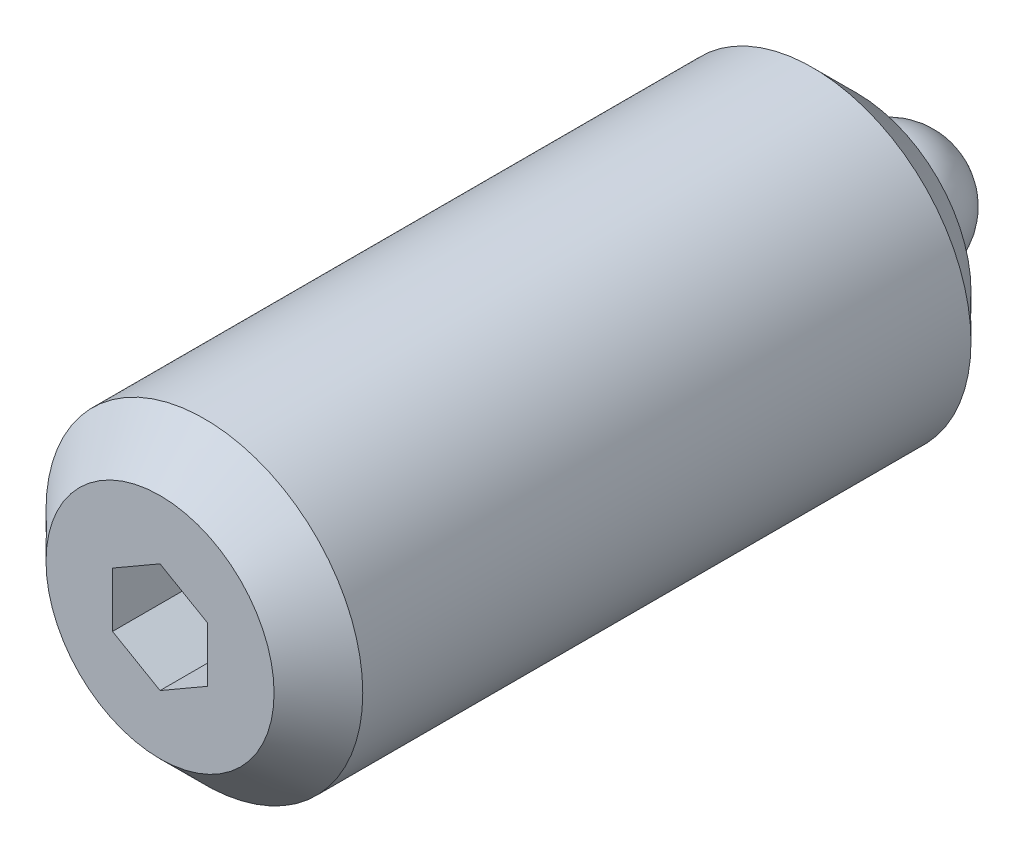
ISO-10303-21;
HEADER;
FILE_DESCRIPTION(('STEP AP214'),'2;1');
FILE_NAME('part.step','',(''),(''),'','','');
FILE_SCHEMA(('AUTOMOTIVE_DESIGN { 1 0 10303 214 1 1 1 1 }'));
ENDSEC;
DATA;
#1=APPLICATION_CONTEXT('core data for automotive mechanical design processes');
#2=APPLICATION_PROTOCOL_DEFINITION('international standard','automotive_design',2000,#1);
#3=PRODUCT_CONTEXT('',#1,'mechanical');
#4=PRODUCT('Part','Part','',(#3));
#5=PRODUCT_RELATED_PRODUCT_CATEGORY('part','',(#4));
#6=PRODUCT_DEFINITION_FORMATION('','',#4);
#7=PRODUCT_DEFINITION_CONTEXT('part definition',#1,'design');
#8=PRODUCT_DEFINITION('design','',#6,#7);
#9=PRODUCT_DEFINITION_SHAPE('','',#8);
#10=(LENGTH_UNIT() NAMED_UNIT(*) SI_UNIT(.MILLI.,.METRE.));
#11=(NAMED_UNIT(*) PLANE_ANGLE_UNIT() SI_UNIT($,.RADIAN.));
#12=(NAMED_UNIT(*) SI_UNIT($,.STERADIAN.) SOLID_ANGLE_UNIT());
#13=UNCERTAINTY_MEASURE_WITH_UNIT(LENGTH_MEASURE(1.E-05),#10,'distance_accuracy_value','');
#14=(GEOMETRIC_REPRESENTATION_CONTEXT(3) GLOBAL_UNCERTAINTY_ASSIGNED_CONTEXT((#13)) GLOBAL_UNIT_ASSIGNED_CONTEXT((#10,
#11,#12)) REPRESENTATION_CONTEXT('',''));
#15=CARTESIAN_POINT('',(0.,0.,0.));
#16=DIRECTION('',(0.,0.,1.));
#17=DIRECTION('',(1.,0.,0.));
#18=AXIS2_PLACEMENT_3D('',#15,#16,#17);
#19=CARTESIAN_POINT('',(0.,5.,25.));
#20=DIRECTION('',(0.,0.,1.));
#21=DIRECTION('',(1.,0.,0.));
#22=AXIS2_PLACEMENT_3D('',#19,#20,#21);
#23=PLANE('',#22);
#24=CARTESIAN_POINT('',(0.,0.,25.));
#25=DIRECTION('',(0.,0.,1.));
#26=DIRECTION('',(1.,0.,0.));
#27=AXIS2_PLACEMENT_3D('',#24,#25,#26);
#28=CIRCLE('',#27,3.6);
#29=CARTESIAN_POINT('',(3.6,0.,25.));
#30=VERTEX_POINT('',#29);
#31=EDGE_CURVE('E9',#30,#30,#28,.T.);
#32=ORIENTED_EDGE('',*,*,#31,.T.);
#33=EDGE_LOOP('',(#32));
#34=FACE_BOUND('',#33,.T.);
#35=DIRECTION('',(0.866025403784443,-0.499999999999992,0.));
#36=VECTOR('',#35,1.);
#37=CARTESIAN_POINT('',(-1.5,-0.866025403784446,25.));
#38=LINE('',#37,#36);
#39=CARTESIAN_POINT('',(-1.5,-0.866025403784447,25.));
#40=VERTEX_POINT('',#39);
#41=CARTESIAN_POINT('',(0.,-1.73205080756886,25.));
#42=VERTEX_POINT('',#41);
#43=EDGE_CURVE('E84',#40,#42,#38,.T.);
#44=ORIENTED_EDGE('',*,*,#43,.F.);
#45=DIRECTION('',(0.,1.,0.));
#46=VECTOR('',#45,1.);
#47=CARTESIAN_POINT('',(-1.5,-0.866025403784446,25.));
#48=LINE('',#47,#46);
#49=CARTESIAN_POINT('',(-1.5,0.866025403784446,25.));
#50=VERTEX_POINT('',#49);
#51=EDGE_CURVE('E29',#40,#50,#48,.T.);
#52=ORIENTED_EDGE('',*,*,#51,.T.);
#53=DIRECTION('',(0.866025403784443,0.499999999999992,0.));
#54=VECTOR('',#53,1.);
#55=CARTESIAN_POINT('',(-1.5,0.866025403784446,25.));
#56=LINE('',#55,#54);
#57=CARTESIAN_POINT('',(0.,1.73205080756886,25.));
#58=VERTEX_POINT('',#57);
#59=EDGE_CURVE('E74',#50,#58,#56,.T.);
#60=ORIENTED_EDGE('',*,*,#59,.T.);
#61=DIRECTION('',(-0.866025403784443,0.499999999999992,0.));
#62=VECTOR('',#61,1.);
#63=CARTESIAN_POINT('',(1.5,0.866025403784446,25.));
#64=LINE('',#63,#62);
#65=CARTESIAN_POINT('',(1.5,0.866025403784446,25.));
#66=VERTEX_POINT('',#65);
#67=EDGE_CURVE('E79',#66,#58,#64,.T.);
#68=ORIENTED_EDGE('',*,*,#67,.F.);
#69=DIRECTION('',(0.,1.,0.));
#70=VECTOR('',#69,1.);
#71=CARTESIAN_POINT('',(1.5,-0.866025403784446,25.));
#72=LINE('',#71,#70);
#73=CARTESIAN_POINT('',(1.5,-0.866025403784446,25.));
#74=VERTEX_POINT('',#73);
#75=EDGE_CURVE('E88',#74,#66,#72,.T.);
#76=ORIENTED_EDGE('',*,*,#75,.F.);
#77=DIRECTION('',(-0.866025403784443,-0.499999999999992,0.));
#78=VECTOR('',#77,1.);
#79=CARTESIAN_POINT('',(1.5,-0.866025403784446,25.));
#80=LINE('',#79,#78);
#81=EDGE_CURVE('E91',#74,#42,#80,.T.);
#82=ORIENTED_EDGE('',*,*,#81,.T.);
#83=EDGE_LOOP('',(#44,#52,#60,#68,#76,#82));
#84=FACE_BOUND('',#83,.T.);
#85=ADVANCED_FACE('F14',(#34,#84),#23,.T.);
#86=CARTESIAN_POINT('',(0.,0.,2.));
#87=DIRECTION('',(-1.,0.,0.));
#88=DIRECTION('',(0.,0.,1.));
#89=AXIS2_PLACEMENT_3D('',#86,#87,#88);
#90=SPHERICAL_SURFACE('',#89,2.);
#91=CARTESIAN_POINT('',(0.,0.,2.));
#92=DIRECTION('',(0.,0.,-1.));
#93=DIRECTION('',(-1.,0.,0.));
#94=AXIS2_PLACEMENT_3D('',#91,#92,#93);
#95=SPHERICAL_SURFACE('',#94,2.);
#96=CARTESIAN_POINT('',(0.,0.,2.));
#97=DIRECTION('',(0.,0.,-1.));
#98=DIRECTION('',(-1.,0.,0.));
#99=AXIS2_PLACEMENT_3D('',#96,#97,#98);
#100=CIRCLE('',#99,2.);
#101=CARTESIAN_POINT('',(-2.,0.,2.));
#102=VERTEX_POINT('',#101);
#103=EDGE_CURVE('E70',#102,#102,#100,.T.);
#104=ORIENTED_EDGE('',*,*,#103,.T.);
#105=EDGE_LOOP('',(#104));
#106=FACE_BOUND('',#105,.T.);
#107=ADVANCED_FACE('F152',(#106),#95,.T.);
#108=CARTESIAN_POINT('',(0.,0.,-1.));
#109=DIRECTION('',(0.,0.,-1.));
#110=DIRECTION('',(-1.,0.,0.));
#111=AXIS2_PLACEMENT_3D('',#108,#109,#110);
#112=CYLINDRICAL_SURFACE('',#111,5.);
#113=CARTESIAN_POINT('',(0.,0.,4.4));
#114=DIRECTION('',(0.,0.,-1.));
#115=DIRECTION('',(-1.,0.,0.));
#116=AXIS2_PLACEMENT_3D('',#113,#114,#115);
#117=CIRCLE('',#116,5.);
#118=CARTESIAN_POINT('',(-5.,0.,4.4));
#119=VERTEX_POINT('',#118);
#120=EDGE_CURVE('E22',#119,#119,#117,.F.);
#121=ORIENTED_EDGE('',*,*,#120,.T.);
#122=EDGE_LOOP('',(#121));
#123=FACE_BOUND('',#122,.T.);
#124=CARTESIAN_POINT('',(0.,0.,23.6));
#125=DIRECTION('',(0.,0.,1.));
#126=DIRECTION('',(1.,0.,0.));
#127=AXIS2_PLACEMENT_3D('',#124,#125,#126);
#128=CIRCLE('',#127,5.);
#129=CARTESIAN_POINT('',(5.,0.,23.6));
#130=VERTEX_POINT('',#129);
#131=EDGE_CURVE('E125',#130,#130,#128,.F.);
#132=ORIENTED_EDGE('',*,*,#131,.T.);
#133=EDGE_LOOP('',(#132));
#134=FACE_BOUND('',#133,.T.);
#135=ADVANCED_FACE('F130',(#123,#134),#112,.T.);
#136=CARTESIAN_POINT('',(0.,2.,3.));
#137=DIRECTION('',(0.,0.,-1.));
#138=DIRECTION('',(-1.,0.,0.));
#139=AXIS2_PLACEMENT_3D('',#136,#137,#138);
#140=PLANE('',#139);
#141=CARTESIAN_POINT('',(0.,0.,3.));
#142=DIRECTION('',(0.,0.,-1.));
#143=DIRECTION('',(-1.,0.,0.));
#144=AXIS2_PLACEMENT_3D('',#141,#142,#143);
#145=CIRCLE('',#144,3.6);
#146=CARTESIAN_POINT('',(-3.6,0.,3.));
#147=VERTEX_POINT('',#146);
#148=EDGE_CURVE('E122',#147,#147,#145,.T.);
#149=ORIENTED_EDGE('',*,*,#148,.T.);
#150=EDGE_LOOP('',(#149));
#151=FACE_BOUND('',#150,.T.);
#152=CARTESIAN_POINT('',(0.,0.,3.));
#153=DIRECTION('',(0.,0.,-1.));
#154=DIRECTION('',(-1.,0.,0.));
#155=AXIS2_PLACEMENT_3D('',#152,#153,#154);
#156=CIRCLE('',#155,2.);
#157=CARTESIAN_POINT('',(-2.,0.,3.));
#158=VERTEX_POINT('',#157);
#159=EDGE_CURVE('E119',#158,#158,#156,.T.);
#160=ORIENTED_EDGE('',*,*,#159,.F.);
#161=EDGE_LOOP('',(#160));
#162=FACE_BOUND('',#161,.T.);
#163=ADVANCED_FACE('F140',(#151,#162),#140,.T.);
#164=CARTESIAN_POINT('',(0.,0.,-1.));
#165=DIRECTION('',(0.,0.,-1.));
#166=DIRECTION('',(-1.,0.,0.));
#167=AXIS2_PLACEMENT_3D('',#164,#165,#166);
#168=CYLINDRICAL_SURFACE('',#167,2.);
#169=ORIENTED_EDGE('',*,*,#159,.T.);
#170=EDGE_LOOP('',(#169));
#171=FACE_BOUND('',#170,.T.);
#172=ORIENTED_EDGE('',*,*,#103,.F.);
#173=EDGE_LOOP('',(#172));
#174=FACE_BOUND('',#173,.T.);
#175=ADVANCED_FACE('F143',(#171,#174),#168,.T.);
#176=CARTESIAN_POINT('',(-1.5,-0.866025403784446,21.5));
#177=DIRECTION('',(1.,0.,0.));
#178=DIRECTION('',(0.,0.,-1.));
#179=AXIS2_PLACEMENT_3D('',#176,#177,#178);
#180=PLANE('',#179);
#181=DIRECTION('',(0.,0.,1.));
#182=VECTOR('',#181,1.);
#183=CARTESIAN_POINT('',(-1.5,0.866025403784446,21.5));
#184=LINE('',#183,#182);
#185=CARTESIAN_POINT('',(-1.5,0.866025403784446,21.5));
#186=VERTEX_POINT('',#185);
#187=EDGE_CURVE('E63',#186,#50,#184,.T.);
#188=ORIENTED_EDGE('',*,*,#187,.T.);
#189=ORIENTED_EDGE('',*,*,#51,.F.);
#190=DIRECTION('',(0.,0.,1.));
#191=VECTOR('',#190,1.);
#192=CARTESIAN_POINT('',(-1.5,-0.866025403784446,21.5));
#193=LINE('',#192,#191);
#194=CARTESIAN_POINT('',(-1.5,-0.866025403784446,21.5));
#195=VERTEX_POINT('',#194);
#196=EDGE_CURVE('E33',#195,#40,#193,.T.);
#197=ORIENTED_EDGE('',*,*,#196,.F.);
#198=DIRECTION('',(0.,1.,0.));
#199=VECTOR('',#198,1.);
#200=CARTESIAN_POINT('',(-1.5,-0.866025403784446,21.5));
#201=LINE('',#200,#199);
#202=EDGE_CURVE('E66',#195,#186,#201,.T.);
#203=ORIENTED_EDGE('',*,*,#202,.T.);
#204=EDGE_LOOP('',(#188,#189,#197,#203));
#205=FACE_BOUND('',#204,.T.);
#206=ADVANCED_FACE('F65',(#205),#180,.T.);
#207=CARTESIAN_POINT('',(-1.5,0.866025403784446,21.5));
#208=DIRECTION('',(0.499999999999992,-0.866025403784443,0.));
#209=DIRECTION('',(0.866025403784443,0.499999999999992,0.));
#210=AXIS2_PLACEMENT_3D('',#207,#208,#209);
#211=PLANE('',#210);
#212=DIRECTION('',(0.,0.,1.));
#213=VECTOR('',#212,1.);
#214=CARTESIAN_POINT('',(0.,1.73205080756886,21.5));
#215=LINE('',#214,#213);
#216=CARTESIAN_POINT('',(0.,1.73205080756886,21.5));
#217=VERTEX_POINT('',#216);
#218=EDGE_CURVE('E71',#217,#58,#215,.T.);
#219=ORIENTED_EDGE('',*,*,#218,.T.);
#220=ORIENTED_EDGE('',*,*,#59,.F.);
#221=ORIENTED_EDGE('',*,*,#187,.F.);
#222=DIRECTION('',(0.866025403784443,0.499999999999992,0.));
#223=VECTOR('',#222,1.);
#224=CARTESIAN_POINT('',(-1.5,0.866025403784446,21.5));
#225=LINE('',#224,#223);
#226=EDGE_CURVE('E95',#186,#217,#225,.T.);
#227=ORIENTED_EDGE('',*,*,#226,.T.);
#228=EDGE_LOOP('',(#219,#220,#221,#227));
#229=FACE_BOUND('',#228,.T.);
#230=ADVANCED_FACE('F75',(#229),#211,.T.);
#231=CARTESIAN_POINT('',(1.5,0.866025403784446,21.5));
#232=DIRECTION('',(0.499999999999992,0.866025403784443,0.));
#233=DIRECTION('',(-0.866025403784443,0.499999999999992,0.));
#234=AXIS2_PLACEMENT_3D('',#231,#232,#233);
#235=PLANE('',#234);
#236=DIRECTION('',(0.,0.,1.));
#237=VECTOR('',#236,1.);
#238=CARTESIAN_POINT('',(1.5,0.866025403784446,21.5));
#239=LINE('',#238,#237);
#240=CARTESIAN_POINT('',(1.5,0.866025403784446,21.5));
#241=VERTEX_POINT('',#240);
#242=EDGE_CURVE('E114',#241,#66,#239,.T.);
#243=ORIENTED_EDGE('',*,*,#242,.T.);
#244=ORIENTED_EDGE('',*,*,#67,.T.);
#245=ORIENTED_EDGE('',*,*,#218,.F.);
#246=DIRECTION('',(-0.866025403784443,0.499999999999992,0.));
#247=VECTOR('',#246,1.);
#248=CARTESIAN_POINT('',(1.5,0.866025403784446,21.5));
#249=LINE('',#248,#247);
#250=EDGE_CURVE('E97',#241,#217,#249,.T.);
#251=ORIENTED_EDGE('',*,*,#250,.F.);
#252=EDGE_LOOP('',(#243,#244,#245,#251));
#253=FACE_BOUND('',#252,.T.);
#254=ADVANCED_FACE('F167',(#253),#235,.F.);
#255=CARTESIAN_POINT('',(1.5,-0.866025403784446,21.5));
#256=DIRECTION('',(1.,0.,0.));
#257=DIRECTION('',(0.,0.,-1.));
#258=AXIS2_PLACEMENT_3D('',#255,#256,#257);
#259=PLANE('',#258);
#260=DIRECTION('',(0.,0.,1.));
#261=VECTOR('',#260,1.);
#262=CARTESIAN_POINT('',(1.5,-0.866025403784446,21.5));
#263=LINE('',#262,#261);
#264=CARTESIAN_POINT('',(1.5,-0.866025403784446,21.5));
#265=VERTEX_POINT('',#264);
#266=EDGE_CURVE('E112',#265,#74,#263,.T.);
#267=ORIENTED_EDGE('',*,*,#266,.T.);
#268=ORIENTED_EDGE('',*,*,#75,.T.);
#269=ORIENTED_EDGE('',*,*,#242,.F.);
#270=DIRECTION('',(0.,1.,0.));
#271=VECTOR('',#270,1.);
#272=CARTESIAN_POINT('',(1.5,-0.866025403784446,21.5));
#273=LINE('',#272,#271);
#274=EDGE_CURVE('E100',#265,#241,#273,.T.);
#275=ORIENTED_EDGE('',*,*,#274,.F.);
#276=EDGE_LOOP('',(#267,#268,#269,#275));
#277=FACE_BOUND('',#276,.T.);
#278=ADVANCED_FACE('F170',(#277),#259,.F.);
#279=CARTESIAN_POINT('',(1.5,-0.866025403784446,21.5));
#280=DIRECTION('',(-0.499999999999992,0.866025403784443,0.));
#281=DIRECTION('',(-0.866025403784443,-0.499999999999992,0.));
#282=AXIS2_PLACEMENT_3D('',#279,#280,#281);
#283=PLANE('',#282);
#284=DIRECTION('',(0.,0.,1.));
#285=VECTOR('',#284,1.);
#286=CARTESIAN_POINT('',(0.,-1.73205080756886,21.5));
#287=LINE('',#286,#285);
#288=CARTESIAN_POINT('',(0.,-1.73205080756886,21.5));
#289=VERTEX_POINT('',#288);
#290=EDGE_CURVE('E110',#289,#42,#287,.T.);
#291=ORIENTED_EDGE('',*,*,#290,.T.);
#292=ORIENTED_EDGE('',*,*,#81,.F.);
#293=ORIENTED_EDGE('',*,*,#266,.F.);
#294=DIRECTION('',(-0.866025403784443,-0.499999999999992,0.));
#295=VECTOR('',#294,1.);
#296=CARTESIAN_POINT('',(1.5,-0.866025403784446,21.5));
#297=LINE('',#296,#295);
#298=EDGE_CURVE('E103',#265,#289,#297,.T.);
#299=ORIENTED_EDGE('',*,*,#298,.T.);
#300=EDGE_LOOP('',(#291,#292,#293,#299));
#301=FACE_BOUND('',#300,.T.);
#302=ADVANCED_FACE('F174',(#301),#283,.T.);
#303=CARTESIAN_POINT('',(-1.5,-0.866025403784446,21.5));
#304=DIRECTION('',(-0.499999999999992,-0.866025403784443,0.));
#305=DIRECTION('',(0.866025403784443,-0.499999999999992,0.));
#306=AXIS2_PLACEMENT_3D('',#303,#304,#305);
#307=PLANE('',#306);
#308=DIRECTION('',(0.866025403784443,-0.499999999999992,0.));
#309=VECTOR('',#308,1.);
#310=CARTESIAN_POINT('',(-1.5,-0.866025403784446,21.5));
#311=LINE('',#310,#309);
#312=EDGE_CURVE('E106',#195,#289,#311,.T.);
#313=ORIENTED_EDGE('',*,*,#312,.F.);
#314=ORIENTED_EDGE('',*,*,#196,.T.);
#315=ORIENTED_EDGE('',*,*,#43,.T.);
#316=ORIENTED_EDGE('',*,*,#290,.F.);
#317=EDGE_LOOP('',(#313,#314,#315,#316));
#318=FACE_BOUND('',#317,.T.);
#319=ADVANCED_FACE('F137',(#318),#307,.F.);
#320=CARTESIAN_POINT('',(-1.5,2.59807621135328,21.5));
#321=DIRECTION('',(0.,0.,1.));
#322=DIRECTION('',(1.,0.,0.));
#323=AXIS2_PLACEMENT_3D('',#320,#321,#322);
#324=PLANE('',#323);
#325=ORIENTED_EDGE('',*,*,#202,.F.);
#326=ORIENTED_EDGE('',*,*,#312,.T.);
#327=ORIENTED_EDGE('',*,*,#298,.F.);
#328=ORIENTED_EDGE('',*,*,#274,.T.);
#329=ORIENTED_EDGE('',*,*,#250,.T.);
#330=ORIENTED_EDGE('',*,*,#226,.F.);
#331=EDGE_LOOP('',(#325,#326,#327,#328,#329,#330));
#332=FACE_BOUND('',#331,.T.);
#333=ADVANCED_FACE('F136',(#332),#324,.T.);
#334=CARTESIAN_POINT('',(0.,0.,3.));
#335=DIRECTION('',(0.,0.,1.));
#336=DIRECTION('',(1.,0.,0.));
#337=AXIS2_PLACEMENT_3D('',#334,#335,#336);
#338=CONICAL_SURFACE('',#337,3.6,0.785398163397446);
#339=ORIENTED_EDGE('',*,*,#120,.F.);
#340=EDGE_LOOP('',(#339));
#341=FACE_BOUND('',#340,.T.);
#342=ORIENTED_EDGE('',*,*,#148,.F.);
#343=EDGE_LOOP('',(#342));
#344=FACE_BOUND('',#343,.T.);
#345=ADVANCED_FACE('F133',(#341,#344),#338,.T.);
#346=CARTESIAN_POINT('',(0.,0.,23.6));
#347=DIRECTION('',(0.,0.,-1.));
#348=DIRECTION('',(-1.,0.,0.));
#349=AXIS2_PLACEMENT_3D('',#346,#347,#348);
#350=CONICAL_SURFACE('',#349,5.,0.785398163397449);
#351=ORIENTED_EDGE('',*,*,#31,.F.);
#352=EDGE_LOOP('',(#351));
#353=FACE_BOUND('',#352,.T.);
#354=ORIENTED_EDGE('',*,*,#131,.F.);
#355=EDGE_LOOP('',(#354));
#356=FACE_BOUND('',#355,.T.);
#357=ADVANCED_FACE('F16',(#353,#356),#350,.T.);
#358=CLOSED_SHELL('',(#85,#107,#135,#163,#175,#206,#230,#254,#278,#302,#319,#333,#345,#357));
#359=MANIFOLD_SOLID_BREP('B1',#358);
#360=ADVANCED_BREP_SHAPE_REPRESENTATION('',(#18,#359),#14);
#361=SHAPE_DEFINITION_REPRESENTATION(#9,#360);
ENDSEC;
END-ISO-10303-21;
